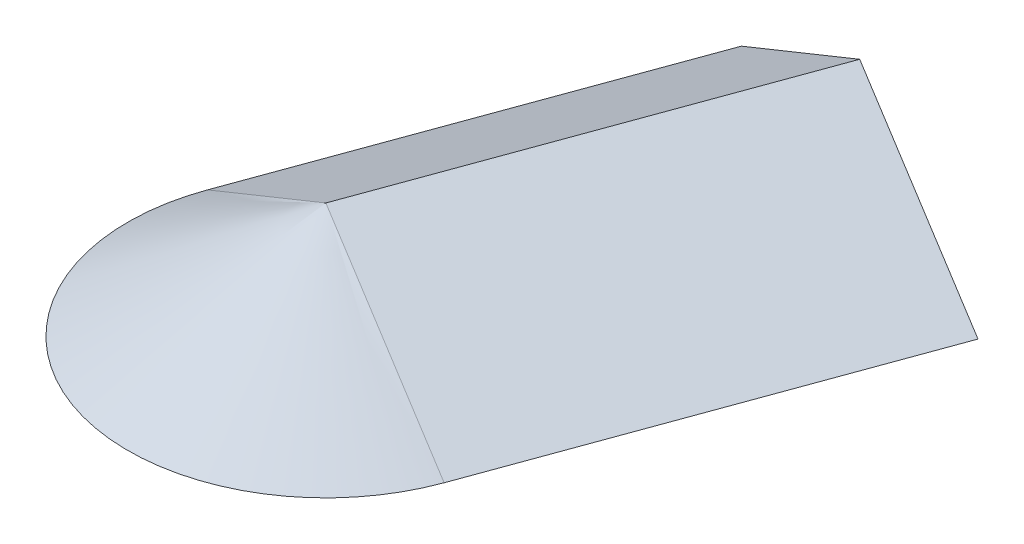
from build123d import *

# Parameters (mm, degrees)
LINEAR_AUSTRAGEN1_DEPTH = 55.4


with BuildPart() as part:
    # Skizze1 → Rotation1 (revolve)
    with BuildSketch(Plane.XY, mode=Mode.PRIVATE) as rotation1_sk:
        Polygon((-26.32560836, 0), (0, 0), (0, 15.356604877), align=None)
    revolve(rotation1_sk.sketch.rotate(Axis((0, 15.356604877, 0), (0, -1, 0)), 90), axis=Axis((0, 15.356604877, 0), (0, -1, 0)))

    # Skizze2 → Linear austragen1 (add)
    with BuildSketch(Plane(origin=(0, 0, 0), x_dir=(-0.9396926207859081, 0, -0.3420201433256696), z_dir=(0.3420201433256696, 0, -0.9396926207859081))):
        Polygon((26.32560836, 0), (0, 15.356604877), (-26.32560836, 0), align=None)
    extrude(amount=LINEAR_AUSTRAGEN1_DEPTH)


solid = part.part
